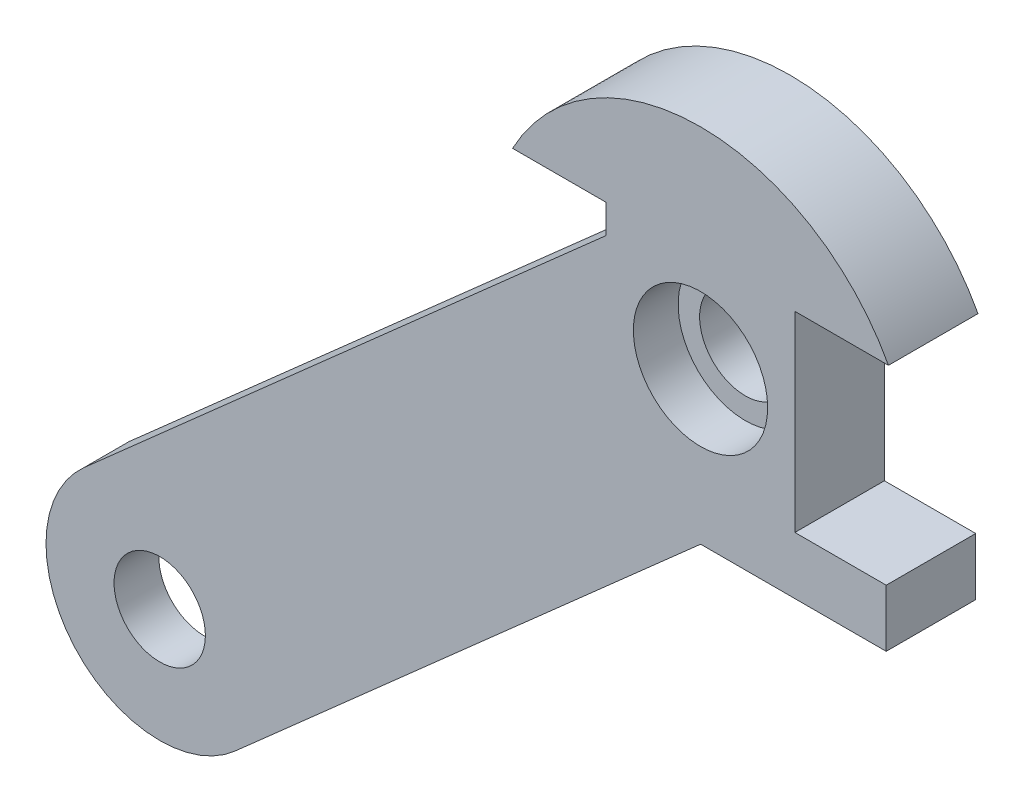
ISO-10303-21;
HEADER;
FILE_DESCRIPTION(('STEP AP214'),'2;1');
FILE_NAME('part.step','',(''),(''),'','','');
FILE_SCHEMA(('AUTOMOTIVE_DESIGN { 1 0 10303 214 1 1 1 1 }'));
ENDSEC;
DATA;
#1=APPLICATION_CONTEXT('core data for automotive mechanical design processes');
#2=APPLICATION_PROTOCOL_DEFINITION('international standard','automotive_design',2000,#1);
#3=PRODUCT_CONTEXT('',#1,'mechanical');
#4=PRODUCT('Part','Part','',(#3));
#5=PRODUCT_RELATED_PRODUCT_CATEGORY('part','',(#4));
#6=PRODUCT_DEFINITION_FORMATION('','',#4);
#7=PRODUCT_DEFINITION_CONTEXT('part definition',#1,'design');
#8=PRODUCT_DEFINITION('design','',#6,#7);
#9=PRODUCT_DEFINITION_SHAPE('','',#8);
#10=(LENGTH_UNIT() NAMED_UNIT(*) SI_UNIT(.MILLI.,.METRE.));
#11=(NAMED_UNIT(*) PLANE_ANGLE_UNIT() SI_UNIT($,.RADIAN.));
#12=(NAMED_UNIT(*) SI_UNIT($,.STERADIAN.) SOLID_ANGLE_UNIT());
#13=UNCERTAINTY_MEASURE_WITH_UNIT(LENGTH_MEASURE(1.E-05),#10,'distance_accuracy_value','');
#14=(GEOMETRIC_REPRESENTATION_CONTEXT(3) GLOBAL_UNCERTAINTY_ASSIGNED_CONTEXT((#13)) GLOBAL_UNIT_ASSIGNED_CONTEXT((#10,
#11,#12)) REPRESENTATION_CONTEXT('',''));
#15=CARTESIAN_POINT('',(0.,0.,0.));
#16=DIRECTION('',(0.,0.,1.));
#17=DIRECTION('',(1.,0.,0.));
#18=AXIS2_PLACEMENT_3D('',#15,#16,#17);
#19=CARTESIAN_POINT('',(-20.74,-16.94245,10.));
#20=DIRECTION('',(0.,1.,0.));
#21=DIRECTION('',(0.,0.,1.));
#22=AXIS2_PLACEMENT_3D('',#19,#20,#21);
#23=PLANE('',#22);
#24=DIRECTION('',(0.,0.,1.));
#25=VECTOR('',#24,1.);
#26=CARTESIAN_POINT('',(0.0163821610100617,-16.94245,10.));
#27=LINE('',#26,#25);
#28=CARTESIAN_POINT('',(0.0163821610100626,-16.94245,5.));
#29=VERTEX_POINT('',#28);
#30=CARTESIAN_POINT('',(0.0163821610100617,-16.94245,10.));
#31=VERTEX_POINT('',#30);
#32=EDGE_CURVE('E219',#29,#31,#27,.T.);
#33=ORIENTED_EDGE('',*,*,#32,.F.);
#34=DIRECTION('',(-1.,0.,0.));
#35=VECTOR('',#34,1.);
#36=CARTESIAN_POINT('',(-20.74,-16.94245,5.));
#37=LINE('',#36,#35);
#38=CARTESIAN_POINT('',(-20.74,-16.94245,5.));
#39=VERTEX_POINT('',#38);
#40=EDGE_CURVE('E189',#29,#39,#37,.T.);
#41=ORIENTED_EDGE('',*,*,#40,.T.);
#42=DIRECTION('',(0.,0.,-1.));
#43=VECTOR('',#42,1.);
#44=CARTESIAN_POINT('',(-20.74,-16.94245,10.));
#45=LINE('',#44,#43);
#46=CARTESIAN_POINT('',(-20.74,-16.94245,0.));
#47=VERTEX_POINT('',#46);
#48=EDGE_CURVE('E41',#39,#47,#45,.T.);
#49=ORIENTED_EDGE('',*,*,#48,.T.);
#50=DIRECTION('',(1.,0.,0.));
#51=VECTOR('',#50,1.);
#52=CARTESIAN_POINT('',(-20.74,-16.94245,0.));
#53=LINE('',#52,#51);
#54=CARTESIAN_POINT('',(20.74,-16.94245,0.));
#55=VERTEX_POINT('',#54);
#56=EDGE_CURVE('E153',#47,#55,#53,.T.);
#57=ORIENTED_EDGE('',*,*,#56,.T.);
#58=DIRECTION('',(0.,0.,-1.));
#59=VECTOR('',#58,1.);
#60=CARTESIAN_POINT('',(20.74,-16.94245,10.));
#61=LINE('',#60,#59);
#62=CARTESIAN_POINT('',(20.74,-16.94245,10.));
#63=VERTEX_POINT('',#62);
#64=EDGE_CURVE('E180',#63,#55,#61,.T.);
#65=ORIENTED_EDGE('',*,*,#64,.F.);
#66=DIRECTION('',(1.,0.,0.));
#67=VECTOR('',#66,1.);
#68=CARTESIAN_POINT('',(-20.74,-16.94245,10.));
#69=LINE('',#68,#67);
#70=EDGE_CURVE('E104',#31,#63,#69,.T.);
#71=ORIENTED_EDGE('',*,*,#70,.F.);
#72=EDGE_LOOP('',(#33,#41,#49,#57,#65,#71));
#73=FACE_BOUND('',#72,.T.);
#74=ADVANCED_FACE('F33',(#73),#23,.F.);
#75=CARTESIAN_POINT('',(-10.54169,-10.5429,10.));
#76=DIRECTION('',(1.,0.,0.));
#77=DIRECTION('',(0.,0.,-1.));
#78=AXIS2_PLACEMENT_3D('',#75,#76,#77);
#79=PLANE('',#78);
#80=DIRECTION('',(0.,0.,-1.));
#81=VECTOR('',#80,1.);
#82=CARTESIAN_POINT('',(-10.54169,7.63044423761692,10.));
#83=LINE('',#82,#81);
#84=CARTESIAN_POINT('',(-10.54169,7.63044423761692,10.));
#85=VERTEX_POINT('',#84);
#86=CARTESIAN_POINT('',(-10.54169,7.63044423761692,5.));
#87=VERTEX_POINT('',#86);
#88=EDGE_CURVE('E217',#85,#87,#83,.T.);
#89=ORIENTED_EDGE('',*,*,#88,.F.);
#90=DIRECTION('',(0.,-1.,0.));
#91=VECTOR('',#90,1.);
#92=CARTESIAN_POINT('',(-10.54169,-10.5429,10.));
#93=LINE('',#92,#91);
#94=CARTESIAN_POINT('',(-10.54169,10.84581,10.));
#95=VERTEX_POINT('',#94);
#96=EDGE_CURVE('E142',#95,#85,#93,.T.);
#97=ORIENTED_EDGE('',*,*,#96,.F.);
#98=DIRECTION('',(0.,0.,-1.));
#99=VECTOR('',#98,1.);
#100=CARTESIAN_POINT('',(-10.54169,10.84581,10.));
#101=LINE('',#100,#99);
#102=CARTESIAN_POINT('',(-10.54169,10.84581,0.));
#103=VERTEX_POINT('',#102);
#104=EDGE_CURVE('E169',#95,#103,#101,.T.);
#105=ORIENTED_EDGE('',*,*,#104,.T.);
#106=DIRECTION('',(0.,-1.,0.));
#107=VECTOR('',#106,1.);
#108=CARTESIAN_POINT('',(-10.54169,-10.5429,0.));
#109=LINE('',#108,#107);
#110=CARTESIAN_POINT('',(-10.54169,-10.5429,0.));
#111=VERTEX_POINT('',#110);
#112=EDGE_CURVE('E166',#103,#111,#109,.T.);
#113=ORIENTED_EDGE('',*,*,#112,.T.);
#114=DIRECTION('',(0.,0.,-1.));
#115=VECTOR('',#114,1.);
#116=CARTESIAN_POINT('',(-10.54169,-10.5429,10.));
#117=LINE('',#116,#115);
#118=CARTESIAN_POINT('',(-10.54169,-10.5429,5.));
#119=VERTEX_POINT('',#118);
#120=EDGE_CURVE('E96',#119,#111,#117,.T.);
#121=ORIENTED_EDGE('',*,*,#120,.F.);
#122=DIRECTION('',(0.,1.,0.));
#123=VECTOR('',#122,1.);
#124=CARTESIAN_POINT('',(-10.54169,-10.5429,5.));
#125=LINE('',#124,#123);
#126=EDGE_CURVE('E227',#119,#87,#125,.T.);
#127=ORIENTED_EDGE('',*,*,#126,.T.);
#128=EDGE_LOOP('',(#89,#97,#105,#113,#121,#127));
#129=FACE_BOUND('',#128,.T.);
#130=ADVANCED_FACE('F325',(#129),#79,.F.);
#131=CARTESIAN_POINT('',(-20.74,-10.5429,10.));
#132=DIRECTION('',(0.,-1.,0.));
#133=DIRECTION('',(1.,0.,0.));
#134=AXIS2_PLACEMENT_3D('',#131,#132,#133);
#135=PLANE('',#134);
#136=DIRECTION('',(0.,0.,-1.));
#137=VECTOR('',#136,1.);
#138=CARTESIAN_POINT('',(-20.74,-10.5429,10.));
#139=LINE('',#138,#137);
#140=CARTESIAN_POINT('',(-20.74,-10.5429,5.));
#141=VERTEX_POINT('',#140);
#142=CARTESIAN_POINT('',(-20.74,-10.5429,0.));
#143=VERTEX_POINT('',#142);
#144=EDGE_CURVE('E11',#141,#143,#139,.T.);
#145=ORIENTED_EDGE('',*,*,#144,.F.);
#146=DIRECTION('',(1.,0.,0.));
#147=VECTOR('',#146,1.);
#148=CARTESIAN_POINT('',(-20.74,-10.5429,5.));
#149=LINE('',#148,#147);
#150=EDGE_CURVE('E225',#141,#119,#149,.T.);
#151=ORIENTED_EDGE('',*,*,#150,.T.);
#152=ORIENTED_EDGE('',*,*,#120,.T.);
#153=DIRECTION('',(-1.,0.,0.));
#154=VECTOR('',#153,1.);
#155=CARTESIAN_POINT('',(-20.74,-10.5429,0.));
#156=LINE('',#155,#154);
#157=EDGE_CURVE('E147',#111,#143,#156,.T.);
#158=ORIENTED_EDGE('',*,*,#157,.T.);
#159=EDGE_LOOP('',(#145,#151,#152,#158));
#160=FACE_BOUND('',#159,.T.);
#161=ADVANCED_FACE('F35',(#160),#135,.F.);
#162=CARTESIAN_POINT('',(-20.74,-16.94245,10.));
#163=DIRECTION('',(1.,0.,0.));
#164=DIRECTION('',(0.,0.,-1.));
#165=AXIS2_PLACEMENT_3D('',#162,#163,#164);
#166=PLANE('',#165);
#167=ORIENTED_EDGE('',*,*,#48,.F.);
#168=DIRECTION('',(0.,1.,0.));
#169=VECTOR('',#168,1.);
#170=CARTESIAN_POINT('',(-20.74,-16.94245,5.));
#171=LINE('',#170,#169);
#172=EDGE_CURVE('E223',#39,#141,#171,.T.);
#173=ORIENTED_EDGE('',*,*,#172,.T.);
#174=ORIENTED_EDGE('',*,*,#144,.T.);
#175=DIRECTION('',(0.,-1.,0.));
#176=VECTOR('',#175,1.);
#177=CARTESIAN_POINT('',(-20.74,-16.94245,0.));
#178=LINE('',#177,#176);
#179=EDGE_CURVE('E149',#143,#47,#178,.T.);
#180=ORIENTED_EDGE('',*,*,#179,.T.);
#181=EDGE_LOOP('',(#167,#173,#174,#180));
#182=FACE_BOUND('',#181,.T.);
#183=ADVANCED_FACE('F193',(#182),#166,.F.);
#184=CARTESIAN_POINT('',(20.74,-16.94245,10.));
#185=DIRECTION('',(-1.,0.,0.));
#186=DIRECTION('',(0.,0.,1.));
#187=AXIS2_PLACEMENT_3D('',#184,#185,#186);
#188=PLANE('',#187);
#189=DIRECTION('',(0.,1.,0.));
#190=VECTOR('',#189,1.);
#191=CARTESIAN_POINT('',(20.74,-16.94245,0.));
#192=LINE('',#191,#190);
#193=CARTESIAN_POINT('',(20.74,-10.5429,0.));
#194=VERTEX_POINT('',#193);
#195=EDGE_CURVE('E155',#55,#194,#192,.T.);
#196=ORIENTED_EDGE('',*,*,#195,.T.);
#197=DIRECTION('',(0.,0.,-1.));
#198=VECTOR('',#197,1.);
#199=CARTESIAN_POINT('',(20.74,-10.5429,10.));
#200=LINE('',#199,#198);
#201=CARTESIAN_POINT('',(20.74,-10.5429,10.));
#202=VERTEX_POINT('',#201);
#203=EDGE_CURVE('E177',#202,#194,#200,.T.);
#204=ORIENTED_EDGE('',*,*,#203,.F.);
#205=DIRECTION('',(0.,1.,0.));
#206=VECTOR('',#205,1.);
#207=CARTESIAN_POINT('',(20.74,-16.94245,10.));
#208=LINE('',#207,#206);
#209=EDGE_CURVE('E210',#63,#202,#208,.T.);
#210=ORIENTED_EDGE('',*,*,#209,.F.);
#211=ORIENTED_EDGE('',*,*,#64,.T.);
#212=EDGE_LOOP('',(#196,#204,#210,#211));
#213=FACE_BOUND('',#212,.T.);
#214=ADVANCED_FACE('F203',(#213),#188,.F.);
#215=CARTESIAN_POINT('',(20.74,-10.5429,10.));
#216=DIRECTION('',(0.,-1.,0.));
#217=DIRECTION('',(1.,0.,0.));
#218=AXIS2_PLACEMENT_3D('',#215,#216,#217);
#219=PLANE('',#218);
#220=DIRECTION('',(-1.,0.,0.));
#221=VECTOR('',#220,1.);
#222=CARTESIAN_POINT('',(20.74,-10.5429,0.));
#223=LINE('',#222,#221);
#224=CARTESIAN_POINT('',(10.54169,-10.5429,0.));
#225=VERTEX_POINT('',#224);
#226=EDGE_CURVE('E157',#194,#225,#223,.T.);
#227=ORIENTED_EDGE('',*,*,#226,.T.);
#228=DIRECTION('',(0.,0.,-1.));
#229=VECTOR('',#228,1.);
#230=CARTESIAN_POINT('',(10.54169,-10.5429,10.));
#231=LINE('',#230,#229);
#232=CARTESIAN_POINT('',(10.54169,-10.5429,10.));
#233=VERTEX_POINT('',#232);
#234=EDGE_CURVE('E174',#233,#225,#231,.T.);
#235=ORIENTED_EDGE('',*,*,#234,.F.);
#236=DIRECTION('',(-1.,0.,0.));
#237=VECTOR('',#236,1.);
#238=CARTESIAN_POINT('',(20.74,-10.5429,10.));
#239=LINE('',#238,#237);
#240=EDGE_CURVE('E209',#202,#233,#239,.T.);
#241=ORIENTED_EDGE('',*,*,#240,.F.);
#242=ORIENTED_EDGE('',*,*,#203,.T.);
#243=EDGE_LOOP('',(#227,#235,#241,#242));
#244=FACE_BOUND('',#243,.T.);
#245=ADVANCED_FACE('F207',(#244),#219,.F.);
#246=CARTESIAN_POINT('',(10.54169,-10.5429,10.));
#247=DIRECTION('',(-1.,0.,0.));
#248=DIRECTION('',(0.,0.,1.));
#249=AXIS2_PLACEMENT_3D('',#246,#247,#248);
#250=PLANE('',#249);
#251=DIRECTION('',(0.,1.,0.));
#252=VECTOR('',#251,1.);
#253=CARTESIAN_POINT('',(10.54169,-10.5429,0.));
#254=LINE('',#253,#252);
#255=CARTESIAN_POINT('',(10.54169,10.84581,0.));
#256=VERTEX_POINT('',#255);
#257=EDGE_CURVE('E159',#225,#256,#254,.T.);
#258=ORIENTED_EDGE('',*,*,#257,.T.);
#259=DIRECTION('',(0.,0.,-1.));
#260=VECTOR('',#259,1.);
#261=CARTESIAN_POINT('',(10.54169,10.84581,10.));
#262=LINE('',#261,#260);
#263=CARTESIAN_POINT('',(10.54169,10.84581,10.));
#264=VERTEX_POINT('',#263);
#265=EDGE_CURVE('E136',#264,#256,#262,.T.);
#266=ORIENTED_EDGE('',*,*,#265,.F.);
#267=DIRECTION('',(0.,1.,0.));
#268=VECTOR('',#267,1.);
#269=CARTESIAN_POINT('',(10.54169,-10.5429,10.));
#270=LINE('',#269,#268);
#271=EDGE_CURVE('E124',#233,#264,#270,.T.);
#272=ORIENTED_EDGE('',*,*,#271,.F.);
#273=ORIENTED_EDGE('',*,*,#234,.T.);
#274=EDGE_LOOP('',(#258,#266,#272,#273));
#275=FACE_BOUND('',#274,.T.);
#276=ADVANCED_FACE('F354',(#275),#250,.F.);
#277=CARTESIAN_POINT('',(10.54169,10.84581,10.));
#278=DIRECTION('',(0.,1.,0.));
#279=DIRECTION('',(0.,0.,1.));
#280=AXIS2_PLACEMENT_3D('',#277,#278,#279);
#281=PLANE('',#280);
#282=DIRECTION('',(1.,0.,0.));
#283=VECTOR('',#282,1.);
#284=CARTESIAN_POINT('',(10.54169,10.84581,0.));
#285=LINE('',#284,#283);
#286=CARTESIAN_POINT('',(20.99169,10.84581,0.));
#287=VERTEX_POINT('',#286);
#288=EDGE_CURVE('E133',#256,#287,#285,.T.);
#289=ORIENTED_EDGE('',*,*,#288,.T.);
#290=DIRECTION('',(0.,0.,-1.));
#291=VECTOR('',#290,1.);
#292=CARTESIAN_POINT('',(20.99169,10.84581,10.));
#293=LINE('',#292,#291);
#294=CARTESIAN_POINT('',(20.99169,10.84581,10.));
#295=VERTEX_POINT('',#294);
#296=EDGE_CURVE('E130',#295,#287,#293,.T.);
#297=ORIENTED_EDGE('',*,*,#296,.F.);
#298=DIRECTION('',(1.,0.,0.));
#299=VECTOR('',#298,1.);
#300=CARTESIAN_POINT('',(10.54169,10.84581,10.));
#301=LINE('',#300,#299);
#302=EDGE_CURVE('E117',#264,#295,#301,.T.);
#303=ORIENTED_EDGE('',*,*,#302,.F.);
#304=ORIENTED_EDGE('',*,*,#265,.T.);
#305=EDGE_LOOP('',(#289,#297,#303,#304));
#306=FACE_BOUND('',#305,.T.);
#307=ADVANCED_FACE('F131',(#306),#281,.F.);
#308=CARTESIAN_POINT('',(0.,-0.369757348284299,10.));
#309=DIRECTION('',(0.,0.,-1.));
#310=DIRECTION('',(-1.,0.,0.));
#311=AXIS2_PLACEMENT_3D('',#308,#309,#310);
#312=CYLINDRICAL_SURFACE('',#311,23.8);
#313=CARTESIAN_POINT('',(0.,-0.369757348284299,0.));
#314=DIRECTION('',(0.,0.,1.));
#315=DIRECTION('',(1.,0.,0.));
#316=AXIS2_PLACEMENT_3D('',#313,#314,#315);
#317=CIRCLE('',#316,23.8);
#318=CARTESIAN_POINT('',(-20.99169,10.84581,0.));
#319=VERTEX_POINT('',#318);
#320=EDGE_CURVE('E162',#287,#319,#317,.T.);
#321=ORIENTED_EDGE('',*,*,#320,.T.);
#322=DIRECTION('',(0.,0.,-1.));
#323=VECTOR('',#322,1.);
#324=CARTESIAN_POINT('',(-20.99169,10.84581,10.));
#325=LINE('',#324,#323);
#326=CARTESIAN_POINT('',(-20.99169,10.84581,10.));
#327=VERTEX_POINT('',#326);
#328=EDGE_CURVE('E137',#327,#319,#325,.T.);
#329=ORIENTED_EDGE('',*,*,#328,.F.);
#330=CARTESIAN_POINT('',(0.,-0.369757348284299,10.));
#331=DIRECTION('',(0.,0.,1.));
#332=DIRECTION('',(1.,0.,0.));
#333=AXIS2_PLACEMENT_3D('',#330,#331,#332);
#334=CIRCLE('',#333,23.8);
#335=EDGE_CURVE('E121',#295,#327,#334,.T.);
#336=ORIENTED_EDGE('',*,*,#335,.F.);
#337=ORIENTED_EDGE('',*,*,#296,.T.);
#338=EDGE_LOOP('',(#321,#329,#336,#337));
#339=FACE_BOUND('',#338,.T.);
#340=ADVANCED_FACE('F139',(#339),#312,.T.);
#341=CARTESIAN_POINT('',(-10.54169,10.84581,10.));
#342=DIRECTION('',(0.,1.,0.));
#343=DIRECTION('',(0.,0.,1.));
#344=AXIS2_PLACEMENT_3D('',#341,#342,#343);
#345=PLANE('',#344);
#346=DIRECTION('',(1.,0.,0.));
#347=VECTOR('',#346,1.);
#348=CARTESIAN_POINT('',(-10.54169,10.84581,0.));
#349=LINE('',#348,#347);
#350=EDGE_CURVE('E164',#319,#103,#349,.T.);
#351=ORIENTED_EDGE('',*,*,#350,.T.);
#352=ORIENTED_EDGE('',*,*,#104,.F.);
#353=DIRECTION('',(1.,0.,0.));
#354=VECTOR('',#353,1.);
#355=CARTESIAN_POINT('',(-10.54169,10.84581,10.));
#356=LINE('',#355,#354);
#357=EDGE_CURVE('E57',#327,#95,#356,.T.);
#358=ORIENTED_EDGE('',*,*,#357,.F.);
#359=ORIENTED_EDGE('',*,*,#328,.T.);
#360=EDGE_LOOP('',(#351,#352,#358,#359));
#361=FACE_BOUND('',#360,.T.);
#362=ADVANCED_FACE('F272',(#361),#345,.F.);
#363=CARTESIAN_POINT('',(0.,-0.369757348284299,10.));
#364=DIRECTION('',(0.,0.,1.));
#365=DIRECTION('',(1.,0.,0.));
#366=AXIS2_PLACEMENT_3D('',#363,#364,#365);
#367=PLANE('',#366);
#368=CARTESIAN_POINT('',(0.,0.,10.));
#369=DIRECTION('',(0.,0.,1.));
#370=DIRECTION('',(1.,0.,0.));
#371=AXIS2_PLACEMENT_3D('',#368,#369,#370);
#372=CIRCLE('',#371,7.5);
#373=CARTESIAN_POINT('',(7.5,0.,10.));
#374=VERTEX_POINT('',#373);
#375=EDGE_CURVE('E260',#374,#374,#372,.T.);
#376=ORIENTED_EDGE('',*,*,#375,.F.);
#377=EDGE_LOOP('',(#376));
#378=FACE_BOUND('',#377,.T.);
#379=CARTESIAN_POINT('',(-60.3995341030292,-53.436993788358,10.));
#380=DIRECTION('',(0.,0.,1.));
#381=DIRECTION('',(1.,0.,0.));
#382=AXIS2_PLACEMENT_3D('',#379,#380,#381);
#383=CIRCLE('',#382,5.09999999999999);
#384=CARTESIAN_POINT('',(-55.2995341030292,-53.436993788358,10.));
#385=VERTEX_POINT('',#384);
#386=EDGE_CURVE('E245',#385,#385,#383,.T.);
#387=ORIENTED_EDGE('',*,*,#386,.F.);
#388=EDGE_LOOP('',(#387));
#389=FACE_BOUND('',#388,.T.);
#390=DIRECTION('',(0.748955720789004,0.662620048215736,0.));
#391=VECTOR('',#390,1.);
#392=CARTESIAN_POINT('',(9.02521622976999,-8.97210689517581,10.));
#393=LINE('',#392,#391);
#394=CARTESIAN_POINT('',(-51.9842594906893,-62.9487314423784,10.));
#395=VERTEX_POINT('',#394);
#396=EDGE_CURVE('E236',#395,#31,#393,.T.);
#397=ORIENTED_EDGE('',*,*,#396,.T.);
#398=ORIENTED_EDGE('',*,*,#70,.T.);
#399=ORIENTED_EDGE('',*,*,#209,.T.);
#400=ORIENTED_EDGE('',*,*,#240,.T.);
#401=ORIENTED_EDGE('',*,*,#271,.T.);
#402=ORIENTED_EDGE('',*,*,#302,.T.);
#403=ORIENTED_EDGE('',*,*,#335,.T.);
#404=ORIENTED_EDGE('',*,*,#357,.T.);
#405=ORIENTED_EDGE('',*,*,#96,.T.);
#406=DIRECTION('',(-0.748955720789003,-0.662620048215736,0.));
#407=VECTOR('',#406,1.);
#408=CARTESIAN_POINT('',(-7.80533299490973,10.0513684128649,10.));
#409=LINE('',#408,#407);
#410=CARTESIAN_POINT('',(-68.814808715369,-43.9252561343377,10.));
#411=VERTEX_POINT('',#410);
#412=EDGE_CURVE('E240',#85,#411,#409,.T.);
#413=ORIENTED_EDGE('',*,*,#412,.T.);
#414=CARTESIAN_POINT('',(-60.3995341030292,-53.436993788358,10.));
#415=DIRECTION('',(0.,0.,1.));
#416=DIRECTION('',(1.,0.,0.));
#417=AXIS2_PLACEMENT_3D('',#414,#415,#416);
#418=CIRCLE('',#417,12.7);
#419=EDGE_CURVE('E247',#411,#395,#418,.T.);
#420=ORIENTED_EDGE('',*,*,#419,.T.);
#421=EDGE_LOOP('',(#397,#398,#399,#400,#401,#402,#403,#404,#405,#413,#420));
#422=FACE_BOUND('',#421,.T.);
#423=ADVANCED_FACE('F119',(#378,#389,#422),#367,.T.);
#424=CARTESIAN_POINT('',(0.,-0.369757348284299,0.));
#425=DIRECTION('',(0.,0.,1.));
#426=DIRECTION('',(1.,0.,0.));
#427=AXIS2_PLACEMENT_3D('',#424,#425,#426);
#428=PLANE('',#427);
#429=CARTESIAN_POINT('',(0.,0.,0.));
#430=DIRECTION('',(0.,0.,1.));
#431=DIRECTION('',(1.,0.,0.));
#432=AXIS2_PLACEMENT_3D('',#429,#430,#431);
#433=CIRCLE('',#432,5.1);
#434=CARTESIAN_POINT('',(5.1,0.,0.));
#435=VERTEX_POINT('',#434);
#436=EDGE_CURVE('E150',#435,#435,#433,.T.);
#437=ORIENTED_EDGE('',*,*,#436,.T.);
#438=EDGE_LOOP('',(#437));
#439=FACE_BOUND('',#438,.T.);
#440=ORIENTED_EDGE('',*,*,#157,.F.);
#441=ORIENTED_EDGE('',*,*,#112,.F.);
#442=ORIENTED_EDGE('',*,*,#350,.F.);
#443=ORIENTED_EDGE('',*,*,#320,.F.);
#444=ORIENTED_EDGE('',*,*,#288,.F.);
#445=ORIENTED_EDGE('',*,*,#257,.F.);
#446=ORIENTED_EDGE('',*,*,#226,.F.);
#447=ORIENTED_EDGE('',*,*,#195,.F.);
#448=ORIENTED_EDGE('',*,*,#56,.F.);
#449=ORIENTED_EDGE('',*,*,#179,.F.);
#450=EDGE_LOOP('',(#440,#441,#442,#443,#444,#445,#446,#447,#448,#449));
#451=FACE_BOUND('',#450,.T.);
#452=ADVANCED_FACE('F198',(#439,#451),#428,.F.);
#453=CARTESIAN_POINT('',(0.,0.,0.));
#454=DIRECTION('',(0.,0.,1.));
#455=DIRECTION('',(1.,0.,0.));
#456=AXIS2_PLACEMENT_3D('',#453,#454,#455);
#457=CYLINDRICAL_SURFACE('',#456,5.1);
#458=CARTESIAN_POINT('',(0.,0.,5.));
#459=DIRECTION('',(0.,0.,1.));
#460=DIRECTION('',(1.,0.,0.));
#461=AXIS2_PLACEMENT_3D('',#458,#459,#460);
#462=CIRCLE('',#461,5.1);
#463=CARTESIAN_POINT('',(5.1,0.,5.));
#464=VERTEX_POINT('',#463);
#465=EDGE_CURVE('E255',#464,#464,#462,.F.);
#466=ORIENTED_EDGE('',*,*,#465,.F.);
#467=EDGE_LOOP('',(#466));
#468=FACE_BOUND('',#467,.T.);
#469=ORIENTED_EDGE('',*,*,#436,.F.);
#470=EDGE_LOOP('',(#469));
#471=FACE_BOUND('',#470,.T.);
#472=ADVANCED_FACE('F387',(#468,#471),#457,.F.);
#473=CARTESIAN_POINT('',(-7.80533299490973,10.0513684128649,10.));
#474=DIRECTION('',(0.662620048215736,-0.748955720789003,0.));
#475=DIRECTION('',(0.748955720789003,0.662620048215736,0.));
#476=AXIS2_PLACEMENT_3D('',#473,#474,#475);
#477=PLANE('',#476);
#478=ORIENTED_EDGE('',*,*,#412,.F.);
#479=ORIENTED_EDGE('',*,*,#88,.T.);
#480=DIRECTION('',(-0.748955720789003,-0.662620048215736,0.));
#481=VECTOR('',#480,1.);
#482=CARTESIAN_POINT('',(-7.80533299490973,10.0513684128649,5.));
#483=LINE('',#482,#481);
#484=CARTESIAN_POINT('',(-68.814808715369,-43.9252561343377,5.));
#485=VERTEX_POINT('',#484);
#486=EDGE_CURVE('E48',#87,#485,#483,.T.);
#487=ORIENTED_EDGE('',*,*,#486,.T.);
#488=DIRECTION('',(0.,0.,-1.));
#489=VECTOR('',#488,1.);
#490=CARTESIAN_POINT('',(-68.814808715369,-43.9252561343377,10.));
#491=LINE('',#490,#489);
#492=EDGE_CURVE('E230',#411,#485,#491,.T.);
#493=ORIENTED_EDGE('',*,*,#492,.F.);
#494=EDGE_LOOP('',(#478,#479,#487,#493));
#495=FACE_BOUND('',#494,.T.);
#496=ADVANCED_FACE('F316',(#495),#477,.F.);
#497=CARTESIAN_POINT('',(9.02521622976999,-8.97210689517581,10.));
#498=DIRECTION('',(-0.662620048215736,0.748955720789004,0.));
#499=DIRECTION('',(-0.748955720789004,-0.662620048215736,0.));
#500=AXIS2_PLACEMENT_3D('',#497,#498,#499);
#501=PLANE('',#500);
#502=DIRECTION('',(0.748955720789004,0.662620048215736,0.));
#503=VECTOR('',#502,1.);
#504=CARTESIAN_POINT('',(9.02521622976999,-8.97210689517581,5.));
#505=LINE('',#504,#503);
#506=CARTESIAN_POINT('',(-51.9842594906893,-62.9487314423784,5.));
#507=VERTEX_POINT('',#506);
#508=EDGE_CURVE('E237',#507,#29,#505,.T.);
#509=ORIENTED_EDGE('',*,*,#508,.T.);
#510=ORIENTED_EDGE('',*,*,#32,.T.);
#511=ORIENTED_EDGE('',*,*,#396,.F.);
#512=DIRECTION('',(0.,0.,-1.));
#513=VECTOR('',#512,1.);
#514=CARTESIAN_POINT('',(-51.9842594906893,-62.9487314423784,10.));
#515=LINE('',#514,#513);
#516=EDGE_CURVE('E233',#395,#507,#515,.T.);
#517=ORIENTED_EDGE('',*,*,#516,.T.);
#518=EDGE_LOOP('',(#509,#510,#511,#517));
#519=FACE_BOUND('',#518,.T.);
#520=ADVANCED_FACE('F286',(#519),#501,.F.);
#521=CARTESIAN_POINT('',(-5.81133637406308,-5.14143611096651,5.));
#522=DIRECTION('',(0.,0.,-1.));
#523=DIRECTION('',(-1.,0.,0.));
#524=AXIS2_PLACEMENT_3D('',#521,#522,#523);
#525=PLANE('',#524);
#526=CARTESIAN_POINT('',(-60.3995341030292,-53.436993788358,5.));
#527=DIRECTION('',(0.,0.,1.));
#528=DIRECTION('',(1.,0.,0.));
#529=AXIS2_PLACEMENT_3D('',#526,#527,#528);
#530=CIRCLE('',#529,5.09999999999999);
#531=CARTESIAN_POINT('',(-55.2995341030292,-53.436993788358,5.));
#532=VERTEX_POINT('',#531);
#533=EDGE_CURVE('E252',#532,#532,#530,.T.);
#534=ORIENTED_EDGE('',*,*,#533,.T.);
#535=EDGE_LOOP('',(#534));
#536=FACE_BOUND('',#535,.T.);
#537=ORIENTED_EDGE('',*,*,#40,.F.);
#538=ORIENTED_EDGE('',*,*,#508,.F.);
#539=CARTESIAN_POINT('',(-60.3995341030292,-53.436993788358,5.));
#540=DIRECTION('',(0.,0.,1.));
#541=DIRECTION('',(1.,0.,0.));
#542=AXIS2_PLACEMENT_3D('',#539,#540,#541);
#543=CIRCLE('',#542,12.7);
#544=EDGE_CURVE('E241',#485,#507,#543,.T.);
#545=ORIENTED_EDGE('',*,*,#544,.F.);
#546=ORIENTED_EDGE('',*,*,#486,.F.);
#547=ORIENTED_EDGE('',*,*,#126,.F.);
#548=ORIENTED_EDGE('',*,*,#150,.F.);
#549=ORIENTED_EDGE('',*,*,#172,.F.);
#550=EDGE_LOOP('',(#537,#538,#545,#546,#547,#548,#549));
#551=FACE_BOUND('',#550,.T.);
#552=ADVANCED_FACE('F284',(#536,#551),#525,.T.);
#553=CARTESIAN_POINT('',(-60.3995341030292,-53.436993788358,10.));
#554=DIRECTION('',(0.,0.,-1.));
#555=DIRECTION('',(-1.,0.,0.));
#556=AXIS2_PLACEMENT_3D('',#553,#554,#555);
#557=CYLINDRICAL_SURFACE('',#556,12.7);
#558=ORIENTED_EDGE('',*,*,#544,.T.);
#559=ORIENTED_EDGE('',*,*,#516,.F.);
#560=ORIENTED_EDGE('',*,*,#419,.F.);
#561=ORIENTED_EDGE('',*,*,#492,.T.);
#562=EDGE_LOOP('',(#558,#559,#560,#561));
#563=FACE_BOUND('',#562,.T.);
#564=ADVANCED_FACE('F280',(#563),#557,.T.);
#565=CARTESIAN_POINT('',(-60.3995341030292,-53.436993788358,10.));
#566=DIRECTION('',(0.,0.,-1.));
#567=DIRECTION('',(-1.,0.,0.));
#568=AXIS2_PLACEMENT_3D('',#565,#566,#567);
#569=CYLINDRICAL_SURFACE('',#568,5.09999999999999);
#570=ORIENTED_EDGE('',*,*,#386,.T.);
#571=EDGE_LOOP('',(#570));
#572=FACE_BOUND('',#571,.T.);
#573=ORIENTED_EDGE('',*,*,#533,.F.);
#574=EDGE_LOOP('',(#573));
#575=FACE_BOUND('',#574,.T.);
#576=ADVANCED_FACE('F276',(#572,#575),#569,.F.);
#577=CARTESIAN_POINT('',(0.,0.,5.));
#578=DIRECTION('',(0.,0.,1.));
#579=DIRECTION('',(1.,0.,0.));
#580=AXIS2_PLACEMENT_3D('',#577,#578,#579);
#581=PLANE('',#580);
#582=CARTESIAN_POINT('',(0.,0.,5.));
#583=DIRECTION('',(0.,0.,1.));
#584=DIRECTION('',(1.,0.,0.));
#585=AXIS2_PLACEMENT_3D('',#582,#583,#584);
#586=CIRCLE('',#585,7.5);
#587=CARTESIAN_POINT('',(7.5,0.,5.));
#588=VERTEX_POINT('',#587);
#589=EDGE_CURVE('E261',#588,#588,#586,.T.);
#590=ORIENTED_EDGE('',*,*,#589,.T.);
#591=EDGE_LOOP('',(#590));
#592=FACE_BOUND('',#591,.T.);
#593=ORIENTED_EDGE('',*,*,#465,.T.);
#594=EDGE_LOOP('',(#593));
#595=FACE_BOUND('',#594,.T.);
#596=ADVANCED_FACE('F279',(#592,#595),#581,.T.);
#597=CARTESIAN_POINT('',(0.,0.,10.));
#598=DIRECTION('',(0.,0.,-1.));
#599=DIRECTION('',(-1.,0.,0.));
#600=AXIS2_PLACEMENT_3D('',#597,#598,#599);
#601=CYLINDRICAL_SURFACE('',#600,7.5);
#602=ORIENTED_EDGE('',*,*,#375,.T.);
#603=EDGE_LOOP('',(#602));
#604=FACE_BOUND('',#603,.T.);
#605=ORIENTED_EDGE('',*,*,#589,.F.);
#606=EDGE_LOOP('',(#605));
#607=FACE_BOUND('',#606,.T.);
#608=ADVANCED_FACE('F267',(#604,#607),#601,.F.);
#609=CLOSED_SHELL('',(#74,#130,#161,#183,#214,#245,#276,#307,#340,#362,#423,#452,#472,#496,#520,
#552,#564,#576,#596,#608));
#610=MANIFOLD_SOLID_BREP('B2',#609);
#611=ADVANCED_BREP_SHAPE_REPRESENTATION('',(#18,#610),#14);
#612=SHAPE_DEFINITION_REPRESENTATION(#9,#611);
ENDSEC;
END-ISO-10303-21;
